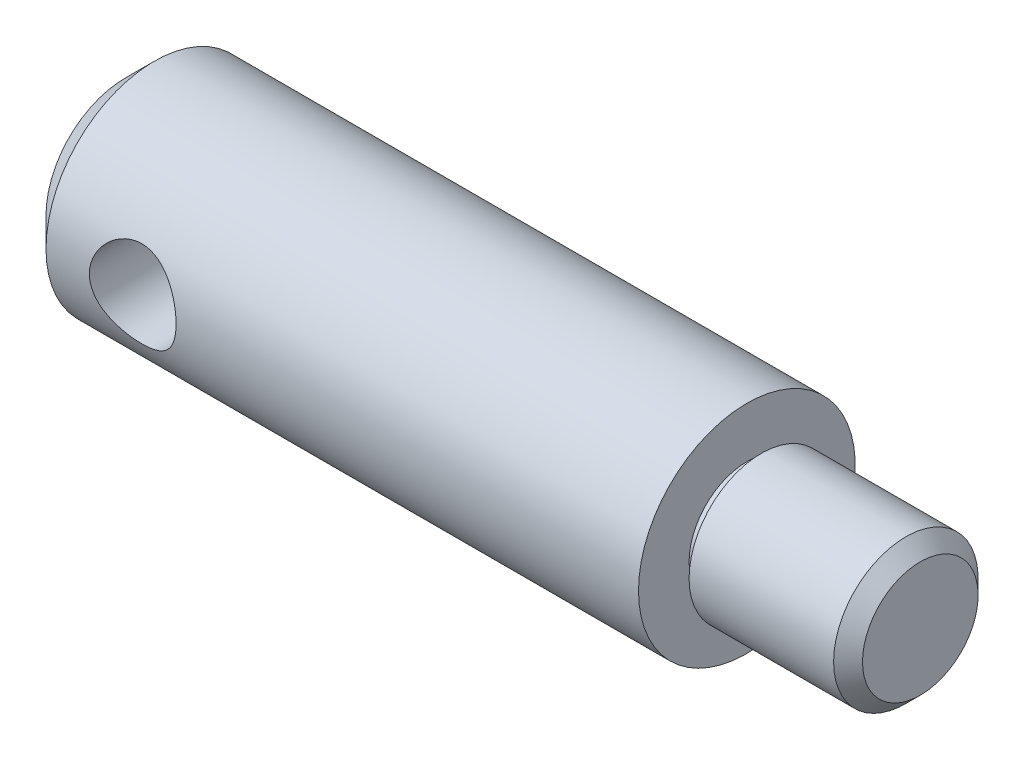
from build123d import *

# Parameters (mm, degrees)
ENL_V_MAT_EXTRU_1_DEPTH      = 57.013391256
ENL_V_MAT_EXTRU_1_DEPTH_BACK = 57.013391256
ESQUISSE2_R                  = 3


with BuildPart() as part:
    # Esquisse1 → Base-R_volution (revolve)
    with BuildSketch(Plane.XY, mode=Mode.PRIVATE) as base_r_volution_sk:
        Polygon((55, 0), (55, 4), (54, 5), (44, 5), (44, 4), (43, 4), (43, 7.5), (2, 7.5), (0, 5.5), (0, 0), align=None)
    revolve(base_r_volution_sk.sketch.rotate(Axis((-44, 0, 0), (1, 0, 0)), 90), axis=Axis((-44, 0, 0), (1, 0, 0)))

    # Esquisse2 → Enl_v. mat.-Extru.1 (cut, two sides: drawn at the far end of the back side and taken through both)
    with BuildSketch(Plane.XY.offset(-ENL_V_MAT_EXTRU_1_DEPTH_BACK)):
        with Locations((8, 0)):
            Circle(ESQUISSE2_R)
    extrude(amount=ENL_V_MAT_EXTRU_1_DEPTH + ENL_V_MAT_EXTRU_1_DEPTH_BACK, mode=Mode.SUBTRACT)


solid = part.part
